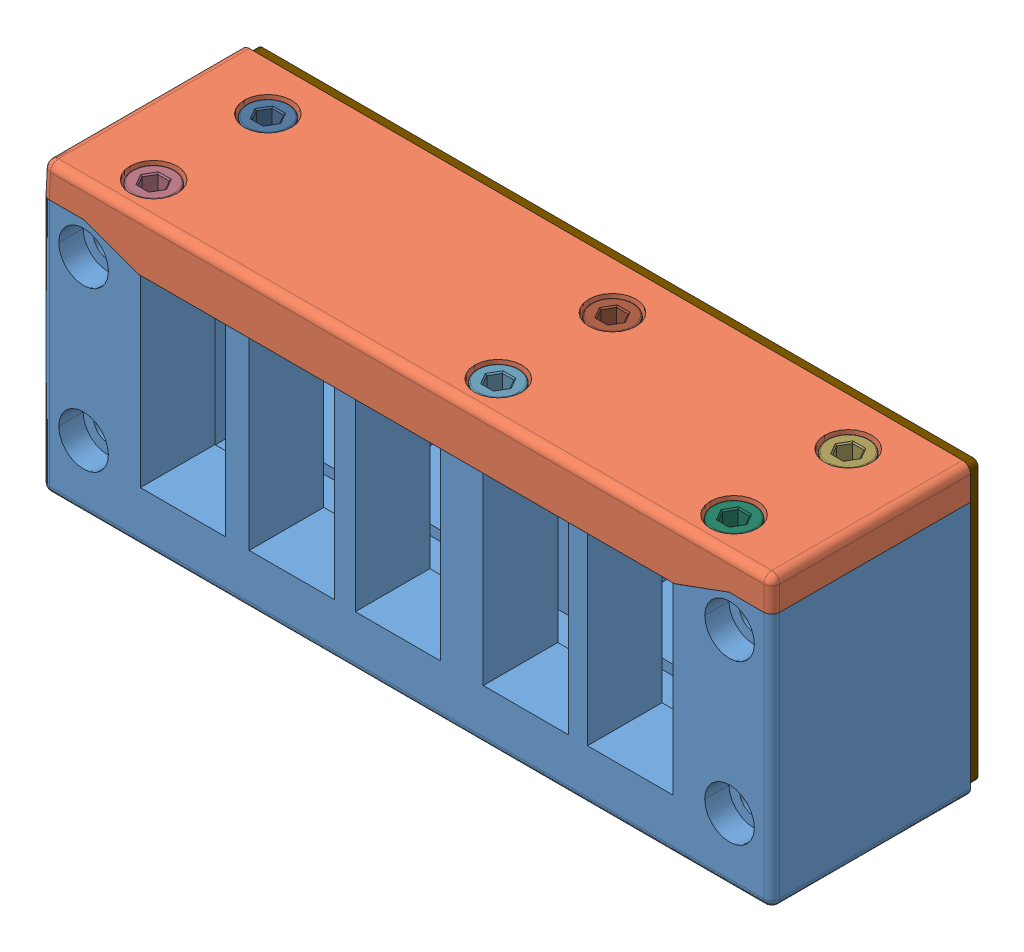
SolidWorks assembly 99410.SLDASM, configuration Default (file format 8000). Lengths in mm.
Overall size (147 58 42.5).
18 component instances, 18 part files, 0 mates.
Components (placement in the parent):
- 99410_01-1: 99410_01.SLDPRT [Default] at origin size (147 51.5 40)
- 99410_02-1: 99410_02.SLDPRT [Default] at origin size (147 10.5 40)
- 99410_03-1: 99410_03.SLDPRT [Default] at origin size (9.25 4.7 8.01)
- 99410_04-1: 99410_04.SLDPRT [Default] at origin size (9.25 4.7 8.01)
- 99410_05-1: 99410_05.SLDPRT [Default] at origin size (9.25 4.7 8.01)
- 99410_06-1: 99410_06.SLDPRT [Default] at origin size (9.25 4.7 8.01)
- 99410_07-1: 99410_07.SLDPRT [Default] at origin size (9.25 4.7 8.01)
- 99410_08-1: 99410_08.SLDPRT [Default] at origin size (9.25 4.7 8.01)
- 99410_09-1: 99410_09.SLDPRT [Default] at origin size (9.25 4.7 8.01)
- 99410_10-1: 99410_10.SLDPRT [Default] at origin size (8.5 57 8.5)
- 99410_11-1: 99410_11.SLDPRT [Default] at origin size (8.5 57 8.5)
- 99410_12-1: 99410_12.SLDPRT [Default] at origin size (8.5 57 8.5)
- 99410_13-1: 99410_13.SLDPRT [Default] at origin size (8.5 57 8.5)
- 99410_14-1: 99410_14.SLDPRT [Default] at origin size (8.5 57 8.5)
- 99410_15-1: 99410_15.SLDPRT [Default] at origin size (8.5 57 8.5)
- 99410_16-1: 99410_16.SLDPRT [Default] at origin size (9.25 4.7 8.01)
- 99410_17-1: 99410_17.SLDPRT [Default] at origin size (9.25 4.7 8.01)
- 99410_18-1: 99410_18.SLDPRT [Default] at origin size (145 56 2.5)
